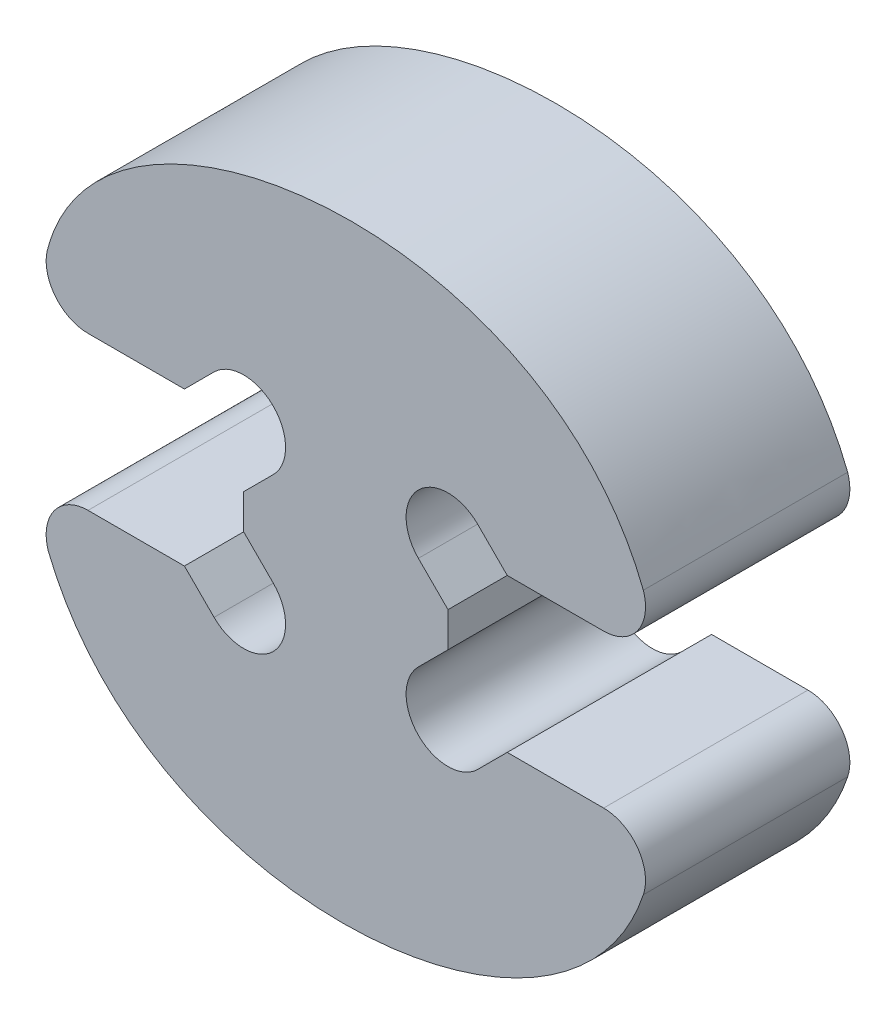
ISO-10303-21;
HEADER;
FILE_DESCRIPTION(('STEP AP214'),'2;1');
FILE_NAME('part.step','',(''),(''),'','','');
FILE_SCHEMA(('AUTOMOTIVE_DESIGN { 1 0 10303 214 1 1 1 1 }'));
ENDSEC;
DATA;
#1=APPLICATION_CONTEXT('core data for automotive mechanical design processes');
#2=APPLICATION_PROTOCOL_DEFINITION('international standard','automotive_design',2000,#1);
#3=PRODUCT_CONTEXT('',#1,'mechanical');
#4=PRODUCT('Part','Part','',(#3));
#5=PRODUCT_RELATED_PRODUCT_CATEGORY('part','',(#4));
#6=PRODUCT_DEFINITION_FORMATION('','',#4);
#7=PRODUCT_DEFINITION_CONTEXT('part definition',#1,'design');
#8=PRODUCT_DEFINITION('design','',#6,#7);
#9=PRODUCT_DEFINITION_SHAPE('','',#8);
#10=(LENGTH_UNIT() NAMED_UNIT(*) SI_UNIT(.MILLI.,.METRE.));
#11=(NAMED_UNIT(*) PLANE_ANGLE_UNIT() SI_UNIT($,.RADIAN.));
#12=(NAMED_UNIT(*) SI_UNIT($,.STERADIAN.) SOLID_ANGLE_UNIT());
#13=UNCERTAINTY_MEASURE_WITH_UNIT(LENGTH_MEASURE(1.E-05),#10,'distance_accuracy_value','');
#14=(GEOMETRIC_REPRESENTATION_CONTEXT(3) GLOBAL_UNCERTAINTY_ASSIGNED_CONTEXT((#13)) GLOBAL_UNIT_ASSIGNED_CONTEXT((#10,
#11,#12)) REPRESENTATION_CONTEXT('',''));
#15=CARTESIAN_POINT('',(0.,0.,0.));
#16=DIRECTION('',(0.,0.,1.));
#17=DIRECTION('',(1.,0.,0.));
#18=AXIS2_PLACEMENT_3D('',#15,#16,#17);
#19=CARTESIAN_POINT('',(547.117913,208.049117,20.));
#20=CARTESIAN_POINT('',(537.299333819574,233.210188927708,20.));
#21=CARTESIAN_POINT('',(494.462376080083,228.041735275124,20.));
#22=CARTESIAN_POINT('',(488.876985,208.049087,20.));
#23=B_SPLINE_CURVE_WITH_KNOTS('',3,(#19,#20,#21,#22),.UNSPECIFIED.,.F.,.F.,(4,4),(0.,1.),.UNSPECIFIED.);
#24=DIRECTION('',(0.,0.,-1.));
#25=VECTOR('',#24,1.);
#26=SURFACE_OF_LINEAR_EXTRUSION('',#23,#25);
#27=CARTESIAN_POINT('',(547.117913,208.049117,0.));
#28=CARTESIAN_POINT('',(537.299333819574,233.210188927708,0.));
#29=CARTESIAN_POINT('',(494.462376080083,228.041735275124,0.));
#30=CARTESIAN_POINT('',(488.876985,208.049087,0.));
#31=B_SPLINE_CURVE_WITH_KNOTS('',3,(#27,#28,#29,#30),.UNSPECIFIED.,.F.,.F.,(4,4),(0.,1.),.UNSPECIFIED.);
#32=CARTESIAN_POINT('',(547.117913,208.049117,0.));
#33=VERTEX_POINT('',#32);
#34=CARTESIAN_POINT('',(488.876985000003,208.049086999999,0.));
#35=VERTEX_POINT('',#34);
#36=EDGE_CURVE('E226',#33,#35,#31,.T.);
#37=ORIENTED_EDGE('',*,*,#36,.T.);
#38=DIRECTION('',(0.,0.,-1.));
#39=VECTOR('',#38,1.);
#40=CARTESIAN_POINT('',(488.876985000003,208.049086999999,20.));
#41=LINE('',#40,#39);
#42=CARTESIAN_POINT('',(488.876985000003,208.049086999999,20.));
#43=VERTEX_POINT('',#42);
#44=EDGE_CURVE('E11',#43,#35,#41,.T.);
#45=ORIENTED_EDGE('',*,*,#44,.F.);
#46=CARTESIAN_POINT('',(547.117913,208.049117,20.));
#47=VERTEX_POINT('',#46);
#48=EDGE_CURVE('E282',#47,#43,#23,.T.);
#49=ORIENTED_EDGE('',*,*,#48,.F.);
#50=DIRECTION('',(0.,0.,-1.));
#51=VECTOR('',#50,1.);
#52=CARTESIAN_POINT('',(547.117913,208.049117,20.));
#53=LINE('',#52,#51);
#54=EDGE_CURVE('E222',#47,#33,#53,.T.);
#55=ORIENTED_EDGE('',*,*,#54,.T.);
#56=EDGE_LOOP('',(#37,#45,#49,#55));
#57=FACE_BOUND('',#56,.T.);
#58=ADVANCED_FACE('F33',(#57),#26,.F.);
#59=CARTESIAN_POINT('',(492.762713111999,206.740997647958,20.));
#60=DIRECTION('',(0.,0.,-1.));
#61=DIRECTION('',(-1.,0.,0.));
#62=AXIS2_PLACEMENT_3D('',#59,#60,#61);
#63=CYLINDRICAL_SURFACE('',#62,4.09999764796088);
#64=CARTESIAN_POINT('',(492.762713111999,206.740997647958,0.));
#65=DIRECTION('',(0.,0.,1.));
#66=DIRECTION('',(1.,0.,0.));
#67=AXIS2_PLACEMENT_3D('',#64,#65,#66);
#68=CIRCLE('',#67,4.09999764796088);
#69=CARTESIAN_POINT('',(492.762713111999,202.640999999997,0.));
#70=VERTEX_POINT('',#69);
#71=EDGE_CURVE('E231',#35,#70,#68,.T.);
#72=ORIENTED_EDGE('',*,*,#71,.T.);
#73=DIRECTION('',(0.,0.,-1.));
#74=VECTOR('',#73,1.);
#75=CARTESIAN_POINT('',(492.762713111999,202.640999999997,20.));
#76=LINE('',#75,#74);
#77=CARTESIAN_POINT('',(492.762713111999,202.640999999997,20.));
#78=VERTEX_POINT('',#77);
#79=EDGE_CURVE('E42',#78,#70,#76,.T.);
#80=ORIENTED_EDGE('',*,*,#79,.F.);
#81=CARTESIAN_POINT('',(492.762713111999,206.740997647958,20.));
#82=DIRECTION('',(0.,0.,1.));
#83=DIRECTION('',(1.,0.,0.));
#84=AXIS2_PLACEMENT_3D('',#81,#82,#83);
#85=CIRCLE('',#84,4.09999764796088);
#86=EDGE_CURVE('E141',#43,#78,#85,.T.);
#87=ORIENTED_EDGE('',*,*,#86,.F.);
#88=ORIENTED_EDGE('',*,*,#44,.T.);
#89=EDGE_LOOP('',(#72,#80,#87,#88));
#90=FACE_BOUND('',#89,.T.);
#91=ADVANCED_FACE('F432',(#90),#63,.T.);
#92=CARTESIAN_POINT('',(492.762713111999,202.641,20.));
#93=DIRECTION('',(0.,1.,0.));
#94=DIRECTION('',(0.,0.,1.));
#95=AXIS2_PLACEMENT_3D('',#92,#93,#94);
#96=PLANE('',#95);
#97=DIRECTION('',(1.,0.,0.));
#98=VECTOR('',#97,1.);
#99=CARTESIAN_POINT('',(492.762713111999,202.641,0.));
#100=LINE('',#99,#98);
#101=CARTESIAN_POINT('',(502.19912,202.641,0.));
#102=VERTEX_POINT('',#101);
#103=EDGE_CURVE('E236',#70,#102,#100,.T.);
#104=ORIENTED_EDGE('',*,*,#103,.T.);
#105=DIRECTION('',(0.,0.,-1.));
#106=VECTOR('',#105,1.);
#107=CARTESIAN_POINT('',(502.19912,202.641,20.));
#108=LINE('',#107,#106);
#109=CARTESIAN_POINT('',(502.19912,202.641,20.));
#110=VERTEX_POINT('',#109);
#111=EDGE_CURVE('E337',#110,#102,#108,.T.);
#112=ORIENTED_EDGE('',*,*,#111,.F.);
#113=DIRECTION('',(1.,0.,0.));
#114=VECTOR('',#113,1.);
#115=CARTESIAN_POINT('',(492.762713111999,202.641,20.));
#116=LINE('',#115,#114);
#117=EDGE_CURVE('E345',#78,#110,#116,.T.);
#118=ORIENTED_EDGE('',*,*,#117,.F.);
#119=ORIENTED_EDGE('',*,*,#79,.T.);
#120=EDGE_LOOP('',(#104,#112,#118,#119));
#121=FACE_BOUND('',#120,.T.);
#122=ADVANCED_FACE('F343',(#121),#96,.F.);
#123=CARTESIAN_POINT('',(502.19912,202.641,20.));
#124=DIRECTION('',(-0.707106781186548,0.707106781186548,0.));
#125=DIRECTION('',(-0.707106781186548,-0.707106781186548,0.));
#126=AXIS2_PLACEMENT_3D('',#123,#124,#125);
#127=PLANE('',#126);
#128=DIRECTION('',(0.707106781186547,0.707106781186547,0.));
#129=VECTOR('',#128,1.);
#130=CARTESIAN_POINT('',(502.19912,202.641,0.));
#131=LINE('',#130,#129);
#132=CARTESIAN_POINT('',(505.09826,205.54014,0.));
#133=VERTEX_POINT('',#132);
#134=EDGE_CURVE('E238',#102,#133,#131,.T.);
#135=ORIENTED_EDGE('',*,*,#134,.T.);
#136=DIRECTION('',(0.,0.,-1.));
#137=VECTOR('',#136,1.);
#138=CARTESIAN_POINT('',(505.09826,205.54014,20.));
#139=LINE('',#138,#137);
#140=CARTESIAN_POINT('',(505.09826,205.54014,20.));
#141=VERTEX_POINT('',#140);
#142=EDGE_CURVE('E334',#141,#133,#139,.T.);
#143=ORIENTED_EDGE('',*,*,#142,.F.);
#144=DIRECTION('',(0.707106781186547,0.707106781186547,0.));
#145=VECTOR('',#144,1.);
#146=CARTESIAN_POINT('',(502.19912,202.641,20.));
#147=LINE('',#146,#145);
#148=EDGE_CURVE('E363',#110,#141,#147,.T.);
#149=ORIENTED_EDGE('',*,*,#148,.F.);
#150=ORIENTED_EDGE('',*,*,#111,.T.);
#151=EDGE_LOOP('',(#135,#143,#149,#150));
#152=FACE_BOUND('',#151,.T.);
#153=ADVANCED_FACE('F354',(#152),#127,.F.);
#154=CARTESIAN_POINT('',(507.9974,202.641,20.));
#155=DIRECTION('',(0.,0.,-1.));
#156=DIRECTION('',(-1.,0.,0.));
#157=AXIS2_PLACEMENT_3D('',#154,#155,#156);
#158=CYLINDRICAL_SURFACE('',#157,4.10000310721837);
#159=CARTESIAN_POINT('',(507.9974,202.641,0.));
#160=DIRECTION('',(0.,0.,-1.));
#161=DIRECTION('',(-1.,0.,0.));
#162=AXIS2_PLACEMENT_3D('',#159,#160,#161);
#163=CIRCLE('',#162,4.10000310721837);
#164=CARTESIAN_POINT('',(510.89654,199.74186,0.));
#165=VERTEX_POINT('',#164);
#166=EDGE_CURVE('E240',#133,#165,#163,.T.);
#167=ORIENTED_EDGE('',*,*,#166,.T.);
#168=DIRECTION('',(0.,0.,-1.));
#169=VECTOR('',#168,1.);
#170=CARTESIAN_POINT('',(510.89654,199.74186,20.));
#171=LINE('',#170,#169);
#172=CARTESIAN_POINT('',(510.89654,199.74186,20.));
#173=VERTEX_POINT('',#172);
#174=EDGE_CURVE('E331',#173,#165,#171,.T.);
#175=ORIENTED_EDGE('',*,*,#174,.F.);
#176=CARTESIAN_POINT('',(507.9974,202.641,20.));
#177=DIRECTION('',(0.,0.,-1.));
#178=DIRECTION('',(-1.,0.,0.));
#179=AXIS2_PLACEMENT_3D('',#176,#177,#178);
#180=CIRCLE('',#179,4.10000310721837);
#181=EDGE_CURVE('E360',#141,#173,#180,.T.);
#182=ORIENTED_EDGE('',*,*,#181,.F.);
#183=ORIENTED_EDGE('',*,*,#142,.T.);
#184=EDGE_LOOP('',(#167,#175,#182,#183));
#185=FACE_BOUND('',#184,.T.);
#186=ADVANCED_FACE('F358',(#185),#158,.F.);
#187=CARTESIAN_POINT('',(510.89654,199.74186,20.));
#188=DIRECTION('',(0.707106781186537,-0.707106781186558,0.));
#189=DIRECTION('',(0.707106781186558,0.707106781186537,0.));
#190=AXIS2_PLACEMENT_3D('',#187,#188,#189);
#191=PLANE('',#190);
#192=DIRECTION('',(-0.707106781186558,-0.707106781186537,0.));
#193=VECTOR('',#192,1.);
#194=CARTESIAN_POINT('',(510.89654,199.74186,0.));
#195=LINE('',#194,#193);
#196=CARTESIAN_POINT('',(507.9974,196.84272,0.));
#197=VERTEX_POINT('',#196);
#198=EDGE_CURVE('E242',#165,#197,#195,.T.);
#199=ORIENTED_EDGE('',*,*,#198,.T.);
#200=DIRECTION('',(0.,0.,-1.));
#201=VECTOR('',#200,1.);
#202=CARTESIAN_POINT('',(507.9974,196.84272,20.));
#203=LINE('',#202,#201);
#204=CARTESIAN_POINT('',(507.9974,196.84272,20.));
#205=VERTEX_POINT('',#204);
#206=EDGE_CURVE('E328',#205,#197,#203,.T.);
#207=ORIENTED_EDGE('',*,*,#206,.F.);
#208=DIRECTION('',(-0.707106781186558,-0.707106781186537,0.));
#209=VECTOR('',#208,1.);
#210=CARTESIAN_POINT('',(510.89654,199.74186,20.));
#211=LINE('',#210,#209);
#212=EDGE_CURVE('E362',#173,#205,#211,.T.);
#213=ORIENTED_EDGE('',*,*,#212,.F.);
#214=ORIENTED_EDGE('',*,*,#174,.T.);
#215=EDGE_LOOP('',(#199,#207,#213,#214));
#216=FACE_BOUND('',#215,.T.);
#217=ADVANCED_FACE('F422',(#216),#191,.F.);
#218=CARTESIAN_POINT('',(507.9974,196.84272,20.));
#219=DIRECTION('',(1.,0.,0.));
#220=DIRECTION('',(0.,0.,-1.));
#221=AXIS2_PLACEMENT_3D('',#218,#219,#220);
#222=PLANE('',#221);
#223=DIRECTION('',(0.,-1.,0.));
#224=VECTOR('',#223,1.);
#225=CARTESIAN_POINT('',(507.9974,196.84272,0.));
#226=LINE('',#225,#224);
#227=CARTESIAN_POINT('',(507.9974,193.43928,0.));
#228=VERTEX_POINT('',#227);
#229=EDGE_CURVE('E244',#197,#228,#226,.T.);
#230=ORIENTED_EDGE('',*,*,#229,.T.);
#231=DIRECTION('',(0.,0.,-1.));
#232=VECTOR('',#231,1.);
#233=CARTESIAN_POINT('',(507.9974,193.43928,20.));
#234=LINE('',#233,#232);
#235=CARTESIAN_POINT('',(507.9974,193.43928,20.));
#236=VERTEX_POINT('',#235);
#237=EDGE_CURVE('E325',#236,#228,#234,.T.);
#238=ORIENTED_EDGE('',*,*,#237,.F.);
#239=DIRECTION('',(0.,-1.,0.));
#240=VECTOR('',#239,1.);
#241=CARTESIAN_POINT('',(507.9974,196.84272,20.));
#242=LINE('',#241,#240);
#243=EDGE_CURVE('E365',#205,#236,#242,.T.);
#244=ORIENTED_EDGE('',*,*,#243,.F.);
#245=ORIENTED_EDGE('',*,*,#206,.T.);
#246=EDGE_LOOP('',(#230,#238,#244,#245));
#247=FACE_BOUND('',#246,.T.);
#248=ADVANCED_FACE('F418',(#247),#222,.F.);
#249=CARTESIAN_POINT('',(507.9974,193.43928,20.));
#250=DIRECTION('',(0.707106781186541,0.707106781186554,0.));
#251=DIRECTION('',(-0.707106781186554,0.707106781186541,0.));
#252=AXIS2_PLACEMENT_3D('',#249,#250,#251);
#253=PLANE('',#252);
#254=DIRECTION('',(0.707106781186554,-0.707106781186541,0.));
#255=VECTOR('',#254,1.);
#256=CARTESIAN_POINT('',(507.9974,193.43928,0.));
#257=LINE('',#256,#255);
#258=CARTESIAN_POINT('',(510.89654,190.54014,0.));
#259=VERTEX_POINT('',#258);
#260=EDGE_CURVE('E246',#228,#259,#257,.T.);
#261=ORIENTED_EDGE('',*,*,#260,.T.);
#262=DIRECTION('',(0.,0.,-1.));
#263=VECTOR('',#262,1.);
#264=CARTESIAN_POINT('',(510.89654,190.54014,20.));
#265=LINE('',#264,#263);
#266=CARTESIAN_POINT('',(510.89654,190.54014,20.));
#267=VERTEX_POINT('',#266);
#268=EDGE_CURVE('E322',#267,#259,#265,.T.);
#269=ORIENTED_EDGE('',*,*,#268,.F.);
#270=DIRECTION('',(0.707106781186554,-0.707106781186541,0.));
#271=VECTOR('',#270,1.);
#272=CARTESIAN_POINT('',(507.9974,193.43928,20.));
#273=LINE('',#272,#271);
#274=EDGE_CURVE('E371',#236,#267,#273,.T.);
#275=ORIENTED_EDGE('',*,*,#274,.F.);
#276=ORIENTED_EDGE('',*,*,#237,.T.);
#277=EDGE_LOOP('',(#261,#269,#275,#276));
#278=FACE_BOUND('',#277,.T.);
#279=ADVANCED_FACE('F414',(#278),#253,.F.);
#280=CARTESIAN_POINT('',(507.9974,187.641,20.));
#281=DIRECTION('',(0.,0.,-1.));
#282=DIRECTION('',(-1.,0.,0.));
#283=AXIS2_PLACEMENT_3D('',#280,#281,#282);
#284=CYLINDRICAL_SURFACE('',#283,4.10000310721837);
#285=CARTESIAN_POINT('',(507.9974,187.641,0.));
#286=DIRECTION('',(0.,0.,-1.));
#287=DIRECTION('',(-1.,0.,0.));
#288=AXIS2_PLACEMENT_3D('',#285,#286,#287);
#289=CIRCLE('',#288,4.10000310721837);
#290=CARTESIAN_POINT('',(505.09826,184.74186,0.));
#291=VERTEX_POINT('',#290);
#292=EDGE_CURVE('E248',#259,#291,#289,.T.);
#293=ORIENTED_EDGE('',*,*,#292,.T.);
#294=DIRECTION('',(0.,0.,-1.));
#295=VECTOR('',#294,1.);
#296=CARTESIAN_POINT('',(505.09826,184.74186,20.));
#297=LINE('',#296,#295);
#298=CARTESIAN_POINT('',(505.09826,184.74186,20.));
#299=VERTEX_POINT('',#298);
#300=EDGE_CURVE('E319',#299,#291,#297,.T.);
#301=ORIENTED_EDGE('',*,*,#300,.F.);
#302=CARTESIAN_POINT('',(507.9974,187.641,20.));
#303=DIRECTION('',(0.,0.,-1.));
#304=DIRECTION('',(-1.,0.,0.));
#305=AXIS2_PLACEMENT_3D('',#302,#303,#304);
#306=CIRCLE('',#305,4.10000310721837);
#307=EDGE_CURVE('E373',#267,#299,#306,.T.);
#308=ORIENTED_EDGE('',*,*,#307,.F.);
#309=ORIENTED_EDGE('',*,*,#268,.T.);
#310=EDGE_LOOP('',(#293,#301,#308,#309));
#311=FACE_BOUND('',#310,.T.);
#312=ADVANCED_FACE('F410',(#311),#284,.F.);
#313=CARTESIAN_POINT('',(505.09826,184.74186,20.));
#314=DIRECTION('',(-0.707106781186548,-0.707106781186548,0.));
#315=DIRECTION('',(0.707106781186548,-0.707106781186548,0.));
#316=AXIS2_PLACEMENT_3D('',#313,#314,#315);
#317=PLANE('',#316);
#318=DIRECTION('',(-0.707106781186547,0.707106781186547,0.));
#319=VECTOR('',#318,1.);
#320=CARTESIAN_POINT('',(505.09826,184.74186,0.));
#321=LINE('',#320,#319);
#322=CARTESIAN_POINT('',(502.19912,187.641,0.));
#323=VERTEX_POINT('',#322);
#324=EDGE_CURVE('E250',#291,#323,#321,.T.);
#325=ORIENTED_EDGE('',*,*,#324,.T.);
#326=DIRECTION('',(0.,0.,-1.));
#327=VECTOR('',#326,1.);
#328=CARTESIAN_POINT('',(502.19912,187.641,20.));
#329=LINE('',#328,#327);
#330=CARTESIAN_POINT('',(502.19912,187.641,20.));
#331=VERTEX_POINT('',#330);
#332=EDGE_CURVE('E316',#331,#323,#329,.T.);
#333=ORIENTED_EDGE('',*,*,#332,.F.);
#334=DIRECTION('',(-0.707106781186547,0.707106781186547,0.));
#335=VECTOR('',#334,1.);
#336=CARTESIAN_POINT('',(505.09826,184.74186,20.));
#337=LINE('',#336,#335);
#338=EDGE_CURVE('E375',#299,#331,#337,.T.);
#339=ORIENTED_EDGE('',*,*,#338,.F.);
#340=ORIENTED_EDGE('',*,*,#300,.T.);
#341=EDGE_LOOP('',(#325,#333,#339,#340));
#342=FACE_BOUND('',#341,.T.);
#343=ADVANCED_FACE('F406',(#342),#317,.F.);
#344=CARTESIAN_POINT('',(502.19912,187.641,20.));
#345=DIRECTION('',(0.,-1.,0.));
#346=DIRECTION('',(0.,0.,-1.));
#347=AXIS2_PLACEMENT_3D('',#344,#345,#346);
#348=PLANE('',#347);
#349=DIRECTION('',(-1.,0.,0.));
#350=VECTOR('',#349,1.);
#351=CARTESIAN_POINT('',(502.19912,187.641,0.));
#352=LINE('',#351,#350);
#353=CARTESIAN_POINT('',(492.76272,187.641,0.));
#354=VERTEX_POINT('',#353);
#355=EDGE_CURVE('E252',#323,#354,#352,.T.);
#356=ORIENTED_EDGE('',*,*,#355,.T.);
#357=DIRECTION('',(0.,0.,-1.));
#358=VECTOR('',#357,1.);
#359=CARTESIAN_POINT('',(492.76272,187.641,20.));
#360=LINE('',#359,#358);
#361=CARTESIAN_POINT('',(492.76272,187.641,20.));
#362=VERTEX_POINT('',#361);
#363=EDGE_CURVE('E313',#362,#354,#360,.T.);
#364=ORIENTED_EDGE('',*,*,#363,.F.);
#365=DIRECTION('',(-1.,0.,0.));
#366=VECTOR('',#365,1.);
#367=CARTESIAN_POINT('',(502.19912,187.641,20.));
#368=LINE('',#367,#366);
#369=EDGE_CURVE('E377',#331,#362,#368,.T.);
#370=ORIENTED_EDGE('',*,*,#369,.F.);
#371=ORIENTED_EDGE('',*,*,#332,.T.);
#372=EDGE_LOOP('',(#356,#364,#370,#371));
#373=FACE_BOUND('',#372,.T.);
#374=ADVANCED_FACE('F402',(#373),#348,.F.);
#375=CARTESIAN_POINT('',(492.762717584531,183.54099768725,20.));
#376=DIRECTION('',(0.,0.,-1.));
#377=DIRECTION('',(-1.,0.,0.));
#378=AXIS2_PLACEMENT_3D('',#375,#376,#377);
#379=CYLINDRICAL_SURFACE('',#378,4.10000231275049);
#380=CARTESIAN_POINT('',(492.762717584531,183.54099768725,0.));
#381=DIRECTION('',(0.,0.,1.));
#382=DIRECTION('',(1.,0.,0.));
#383=AXIS2_PLACEMENT_3D('',#380,#381,#382);
#384=CIRCLE('',#383,4.10000231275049);
#385=CARTESIAN_POINT('',(488.876985,182.232907,0.));
#386=VERTEX_POINT('',#385);
#387=EDGE_CURVE('E254',#354,#386,#384,.T.);
#388=ORIENTED_EDGE('',*,*,#387,.T.);
#389=DIRECTION('',(0.,0.,-1.));
#390=VECTOR('',#389,1.);
#391=CARTESIAN_POINT('',(488.876985,182.232907,20.));
#392=LINE('',#391,#390);
#393=CARTESIAN_POINT('',(488.876985,182.232907,20.));
#394=VERTEX_POINT('',#393);
#395=EDGE_CURVE('E310',#394,#386,#392,.T.);
#396=ORIENTED_EDGE('',*,*,#395,.F.);
#397=CARTESIAN_POINT('',(492.762717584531,183.54099768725,20.));
#398=DIRECTION('',(0.,0.,1.));
#399=DIRECTION('',(1.,0.,0.));
#400=AXIS2_PLACEMENT_3D('',#397,#398,#399);
#401=CIRCLE('',#400,4.10000231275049);
#402=EDGE_CURVE('E379',#362,#394,#401,.T.);
#403=ORIENTED_EDGE('',*,*,#402,.F.);
#404=ORIENTED_EDGE('',*,*,#363,.T.);
#405=EDGE_LOOP('',(#388,#396,#403,#404));
#406=FACE_BOUND('',#405,.T.);
#407=ADVANCED_FACE('F397',(#406),#379,.T.);
#408=CARTESIAN_POINT('',(488.876985,182.232907,20.));
#409=CARTESIAN_POINT('',(498.801346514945,157.679524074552,20.));
#410=CARTESIAN_POINT('',(540.107475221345,161.211357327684,20.));
#411=CARTESIAN_POINT('',(547.117915,182.232877,20.));
#412=B_SPLINE_CURVE_WITH_KNOTS('',3,(#408,#409,#410,#411),.UNSPECIFIED.,.F.,.F.,(4,4),(0.,1.),.UNSPECIFIED.);
#413=DIRECTION('',(0.,0.,-1.));
#414=VECTOR('',#413,1.);
#415=SURFACE_OF_LINEAR_EXTRUSION('',#412,#414);
#416=CARTESIAN_POINT('',(488.876985,182.232907,0.));
#417=CARTESIAN_POINT('',(498.801346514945,157.679524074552,0.));
#418=CARTESIAN_POINT('',(540.107475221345,161.211357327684,0.));
#419=CARTESIAN_POINT('',(547.117915,182.232877,0.));
#420=B_SPLINE_CURVE_WITH_KNOTS('',3,(#416,#417,#418,#419),.UNSPECIFIED.,.F.,.F.,(4,4),(0.,1.),.UNSPECIFIED.);
#421=CARTESIAN_POINT('',(547.117915,182.232877,0.));
#422=VERTEX_POINT('',#421);
#423=EDGE_CURVE('E256',#386,#422,#420,.T.);
#424=ORIENTED_EDGE('',*,*,#423,.T.);
#425=DIRECTION('',(0.,0.,-1.));
#426=VECTOR('',#425,1.);
#427=CARTESIAN_POINT('',(547.117915,182.232877,20.));
#428=LINE('',#427,#426);
#429=CARTESIAN_POINT('',(547.117915,182.232877,20.));
#430=VERTEX_POINT('',#429);
#431=EDGE_CURVE('E307',#430,#422,#428,.T.);
#432=ORIENTED_EDGE('',*,*,#431,.F.);
#433=EDGE_CURVE('E381',#394,#430,#412,.T.);
#434=ORIENTED_EDGE('',*,*,#433,.F.);
#435=ORIENTED_EDGE('',*,*,#395,.T.);
#436=EDGE_LOOP('',(#424,#432,#434,#435));
#437=FACE_BOUND('',#436,.T.);
#438=ADVANCED_FACE('F392',(#437),#415,.F.);
#439=CARTESIAN_POINT('',(543.232196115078,183.541000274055,20.));
#440=DIRECTION('',(0.,0.,-1.));
#441=DIRECTION('',(-1.,0.,0.));
#442=AXIS2_PLACEMENT_3D('',#439,#440,#441);
#443=CYLINDRICAL_SURFACE('',#442,4.09999972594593);
#444=CARTESIAN_POINT('',(543.232196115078,183.541000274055,0.));
#445=DIRECTION('',(0.,0.,1.));
#446=DIRECTION('',(1.,0.,0.));
#447=AXIS2_PLACEMENT_3D('',#444,#445,#446);
#448=CIRCLE('',#447,4.09999972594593);
#449=CARTESIAN_POINT('',(543.232196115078,187.641000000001,0.));
#450=VERTEX_POINT('',#449);
#451=EDGE_CURVE('E260',#422,#450,#448,.T.);
#452=ORIENTED_EDGE('',*,*,#451,.T.);
#453=DIRECTION('',(0.,0.,-1.));
#454=VECTOR('',#453,1.);
#455=CARTESIAN_POINT('',(543.232196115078,187.641000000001,20.));
#456=LINE('',#455,#454);
#457=CARTESIAN_POINT('',(543.232196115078,187.641000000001,20.));
#458=VERTEX_POINT('',#457);
#459=EDGE_CURVE('E304',#458,#450,#456,.T.);
#460=ORIENTED_EDGE('',*,*,#459,.F.);
#461=CARTESIAN_POINT('',(543.232196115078,183.541000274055,20.));
#462=DIRECTION('',(0.,0.,1.));
#463=DIRECTION('',(1.,0.,0.));
#464=AXIS2_PLACEMENT_3D('',#461,#462,#463);
#465=CIRCLE('',#464,4.09999972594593);
#466=EDGE_CURVE('E386',#430,#458,#465,.T.);
#467=ORIENTED_EDGE('',*,*,#466,.F.);
#468=ORIENTED_EDGE('',*,*,#431,.T.);
#469=EDGE_LOOP('',(#452,#460,#467,#468));
#470=FACE_BOUND('',#469,.T.);
#471=ADVANCED_FACE('F396',(#470),#443,.T.);
#472=CARTESIAN_POINT('',(533.79568,187.641,20.));
#473=DIRECTION('',(0.,-1.,0.));
#474=DIRECTION('',(0.,0.,-1.));
#475=AXIS2_PLACEMENT_3D('',#472,#473,#474);
#476=PLANE('',#475);
#477=DIRECTION('',(-1.,0.,0.));
#478=VECTOR('',#477,1.);
#479=CARTESIAN_POINT('',(533.79568,187.641,0.));
#480=LINE('',#479,#478);
#481=CARTESIAN_POINT('',(533.79568,187.641,0.));
#482=VERTEX_POINT('',#481);
#483=EDGE_CURVE('E265',#450,#482,#480,.T.);
#484=ORIENTED_EDGE('',*,*,#483,.T.);
#485=DIRECTION('',(0.,0.,-1.));
#486=VECTOR('',#485,1.);
#487=CARTESIAN_POINT('',(533.79568,187.641,20.));
#488=LINE('',#487,#486);
#489=CARTESIAN_POINT('',(533.79568,187.641,20.));
#490=VERTEX_POINT('',#489);
#491=EDGE_CURVE('E301',#490,#482,#488,.T.);
#492=ORIENTED_EDGE('',*,*,#491,.F.);
#493=DIRECTION('',(-1.,0.,0.));
#494=VECTOR('',#493,1.);
#495=CARTESIAN_POINT('',(533.79568,187.641,20.));
#496=LINE('',#495,#494);
#497=EDGE_CURVE('E481',#458,#490,#496,.T.);
#498=ORIENTED_EDGE('',*,*,#497,.F.);
#499=ORIENTED_EDGE('',*,*,#459,.T.);
#500=EDGE_LOOP('',(#484,#492,#498,#499));
#501=FACE_BOUND('',#500,.T.);
#502=ADVANCED_FACE('F478',(#501),#476,.F.);
#503=CARTESIAN_POINT('',(533.79568,187.641,20.));
#504=DIRECTION('',(0.707106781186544,-0.707106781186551,0.));
#505=DIRECTION('',(0.707106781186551,0.707106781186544,0.));
#506=AXIS2_PLACEMENT_3D('',#503,#504,#505);
#507=PLANE('',#506);
#508=DIRECTION('',(-0.707106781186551,-0.707106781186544,0.));
#509=VECTOR('',#508,1.);
#510=CARTESIAN_POINT('',(533.79568,187.641,0.));
#511=LINE('',#510,#509);
#512=CARTESIAN_POINT('',(530.89654,184.74186,0.));
#513=VERTEX_POINT('',#512);
#514=EDGE_CURVE('E267',#482,#513,#511,.T.);
#515=ORIENTED_EDGE('',*,*,#514,.T.);
#516=DIRECTION('',(0.,0.,-1.));
#517=VECTOR('',#516,1.);
#518=CARTESIAN_POINT('',(530.89654,184.74186,20.));
#519=LINE('',#518,#517);
#520=CARTESIAN_POINT('',(530.89654,184.74186,20.));
#521=VERTEX_POINT('',#520);
#522=EDGE_CURVE('E298',#521,#513,#519,.T.);
#523=ORIENTED_EDGE('',*,*,#522,.F.);
#524=DIRECTION('',(-0.707106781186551,-0.707106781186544,0.));
#525=VECTOR('',#524,1.);
#526=CARTESIAN_POINT('',(533.79568,187.641,20.));
#527=LINE('',#526,#525);
#528=EDGE_CURVE('E472',#490,#521,#527,.T.);
#529=ORIENTED_EDGE('',*,*,#528,.F.);
#530=ORIENTED_EDGE('',*,*,#491,.T.);
#531=EDGE_LOOP('',(#515,#523,#529,#530));
#532=FACE_BOUND('',#531,.T.);
#533=ADVANCED_FACE('F471',(#532),#507,.F.);
#534=CARTESIAN_POINT('',(527.9974,187.641,20.));
#535=DIRECTION('',(0.,0.,-1.));
#536=DIRECTION('',(-1.,0.,0.));
#537=AXIS2_PLACEMENT_3D('',#534,#535,#536);
#538=CYLINDRICAL_SURFACE('',#537,4.10000310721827);
#539=CARTESIAN_POINT('',(527.9974,187.641,0.));
#540=DIRECTION('',(0.,0.,-1.));
#541=DIRECTION('',(-1.,0.,0.));
#542=AXIS2_PLACEMENT_3D('',#539,#540,#541);
#543=CIRCLE('',#542,4.10000310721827);
#544=CARTESIAN_POINT('',(525.09826,190.54014,0.));
#545=VERTEX_POINT('',#544);
#546=EDGE_CURVE('E269',#513,#545,#543,.T.);
#547=ORIENTED_EDGE('',*,*,#546,.T.);
#548=DIRECTION('',(0.,0.,-1.));
#549=VECTOR('',#548,1.);
#550=CARTESIAN_POINT('',(525.09826,190.54014,20.));
#551=LINE('',#550,#549);
#552=CARTESIAN_POINT('',(525.09826,190.54014,20.));
#553=VERTEX_POINT('',#552);
#554=EDGE_CURVE('E295',#553,#545,#551,.T.);
#555=ORIENTED_EDGE('',*,*,#554,.F.);
#556=CARTESIAN_POINT('',(527.9974,187.641,20.));
#557=DIRECTION('',(0.,0.,-1.));
#558=DIRECTION('',(-1.,0.,0.));
#559=AXIS2_PLACEMENT_3D('',#556,#557,#558);
#560=CIRCLE('',#559,4.10000310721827);
#561=EDGE_CURVE('E467',#521,#553,#560,.T.);
#562=ORIENTED_EDGE('',*,*,#561,.F.);
#563=ORIENTED_EDGE('',*,*,#522,.T.);
#564=EDGE_LOOP('',(#547,#555,#562,#563));
#565=FACE_BOUND('',#564,.T.);
#566=ADVANCED_FACE('F466',(#565),#538,.F.);
#567=CARTESIAN_POINT('',(525.09826,190.54014,20.));
#568=DIRECTION('',(-0.707106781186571,0.707106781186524,0.));
#569=DIRECTION('',(-0.707106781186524,-0.707106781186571,0.));
#570=AXIS2_PLACEMENT_3D('',#567,#568,#569);
#571=PLANE('',#570);
#572=DIRECTION('',(0.707106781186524,0.707106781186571,0.));
#573=VECTOR('',#572,1.);
#574=CARTESIAN_POINT('',(525.09826,190.54014,0.));
#575=LINE('',#574,#573);
#576=CARTESIAN_POINT('',(527.9974,193.43928,0.));
#577=VERTEX_POINT('',#576);
#578=EDGE_CURVE('E271',#545,#577,#575,.T.);
#579=ORIENTED_EDGE('',*,*,#578,.T.);
#580=DIRECTION('',(0.,0.,-1.));
#581=VECTOR('',#580,1.);
#582=CARTESIAN_POINT('',(527.9974,193.43928,20.));
#583=LINE('',#582,#581);
#584=CARTESIAN_POINT('',(527.9974,193.43928,20.));
#585=VERTEX_POINT('',#584);
#586=EDGE_CURVE('E292',#585,#577,#583,.T.);
#587=ORIENTED_EDGE('',*,*,#586,.F.);
#588=DIRECTION('',(0.707106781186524,0.707106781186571,0.));
#589=VECTOR('',#588,1.);
#590=CARTESIAN_POINT('',(525.09826,190.54014,20.));
#591=LINE('',#590,#589);
#592=EDGE_CURVE('E463',#553,#585,#591,.T.);
#593=ORIENTED_EDGE('',*,*,#592,.F.);
#594=ORIENTED_EDGE('',*,*,#554,.T.);
#595=EDGE_LOOP('',(#579,#587,#593,#594));
#596=FACE_BOUND('',#595,.T.);
#597=ADVANCED_FACE('F460',(#596),#571,.F.);
#598=CARTESIAN_POINT('',(527.9974,193.43928,20.));
#599=DIRECTION('',(-1.,0.,0.));
#600=DIRECTION('',(0.,0.,1.));
#601=AXIS2_PLACEMENT_3D('',#598,#599,#600);
#602=PLANE('',#601);
#603=DIRECTION('',(0.,1.,0.));
#604=VECTOR('',#603,1.);
#605=CARTESIAN_POINT('',(527.9974,193.43928,0.));
#606=LINE('',#605,#604);
#607=CARTESIAN_POINT('',(527.9974,196.84272,0.));
#608=VERTEX_POINT('',#607);
#609=EDGE_CURVE('E273',#577,#608,#606,.T.);
#610=ORIENTED_EDGE('',*,*,#609,.T.);
#611=DIRECTION('',(0.,0.,-1.));
#612=VECTOR('',#611,1.);
#613=CARTESIAN_POINT('',(527.9974,196.84272,20.));
#614=LINE('',#613,#612);
#615=CARTESIAN_POINT('',(527.9974,196.84272,20.));
#616=VERTEX_POINT('',#615);
#617=EDGE_CURVE('E289',#616,#608,#614,.T.);
#618=ORIENTED_EDGE('',*,*,#617,.F.);
#619=DIRECTION('',(0.,1.,0.));
#620=VECTOR('',#619,1.);
#621=CARTESIAN_POINT('',(527.9974,193.43928,20.));
#622=LINE('',#621,#620);
#623=EDGE_CURVE('E454',#585,#616,#622,.T.);
#624=ORIENTED_EDGE('',*,*,#623,.F.);
#625=ORIENTED_EDGE('',*,*,#586,.T.);
#626=EDGE_LOOP('',(#610,#618,#624,#625));
#627=FACE_BOUND('',#626,.T.);
#628=ADVANCED_FACE('F453',(#627),#602,.F.);
#629=CARTESIAN_POINT('',(527.9974,196.84272,20.));
#630=DIRECTION('',(-0.707106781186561,-0.707106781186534,0.));
#631=DIRECTION('',(0.707106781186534,-0.707106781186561,0.));
#632=AXIS2_PLACEMENT_3D('',#629,#630,#631);
#633=PLANE('',#632);
#634=DIRECTION('',(-0.707106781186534,0.707106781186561,0.));
#635=VECTOR('',#634,1.);
#636=CARTESIAN_POINT('',(527.9974,196.84272,0.));
#637=LINE('',#636,#635);
#638=CARTESIAN_POINT('',(525.09826,199.74186,0.));
#639=VERTEX_POINT('',#638);
#640=EDGE_CURVE('E275',#608,#639,#637,.T.);
#641=ORIENTED_EDGE('',*,*,#640,.T.);
#642=DIRECTION('',(0.,0.,-1.));
#643=VECTOR('',#642,1.);
#644=CARTESIAN_POINT('',(525.09826,199.74186,20.));
#645=LINE('',#644,#643);
#646=CARTESIAN_POINT('',(525.09826,199.74186,20.));
#647=VERTEX_POINT('',#646);
#648=EDGE_CURVE('E286',#647,#639,#645,.T.);
#649=ORIENTED_EDGE('',*,*,#648,.F.);
#650=DIRECTION('',(-0.707106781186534,0.707106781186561,0.));
#651=VECTOR('',#650,1.);
#652=CARTESIAN_POINT('',(527.9974,196.84272,20.));
#653=LINE('',#652,#651);
#654=EDGE_CURVE('E449',#616,#647,#653,.T.);
#655=ORIENTED_EDGE('',*,*,#654,.F.);
#656=ORIENTED_EDGE('',*,*,#617,.T.);
#657=EDGE_LOOP('',(#641,#649,#655,#656));
#658=FACE_BOUND('',#657,.T.);
#659=ADVANCED_FACE('F448',(#658),#633,.F.);
#660=CARTESIAN_POINT('',(527.9974,202.641,20.));
#661=DIRECTION('',(0.,0.,-1.));
#662=DIRECTION('',(-1.,0.,0.));
#663=AXIS2_PLACEMENT_3D('',#660,#661,#662);
#664=CYLINDRICAL_SURFACE('',#663,4.1000031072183);
#665=CARTESIAN_POINT('',(527.9974,202.641,0.));
#666=DIRECTION('',(0.,0.,-1.));
#667=DIRECTION('',(1.,0.,0.));
#668=AXIS2_PLACEMENT_3D('',#665,#666,#667);
#669=CIRCLE('',#668,4.1000031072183);
#670=CARTESIAN_POINT('',(530.89654,205.54014,0.));
#671=VERTEX_POINT('',#670);
#672=EDGE_CURVE('E277',#639,#671,#669,.T.);
#673=ORIENTED_EDGE('',*,*,#672,.T.);
#674=DIRECTION('',(0.,0.,-1.));
#675=VECTOR('',#674,1.);
#676=CARTESIAN_POINT('',(530.89654,205.54014,20.));
#677=LINE('',#676,#675);
#678=CARTESIAN_POINT('',(530.89654,205.54014,20.));
#679=VERTEX_POINT('',#678);
#680=EDGE_CURVE('E217',#679,#671,#677,.T.);
#681=ORIENTED_EDGE('',*,*,#680,.F.);
#682=CARTESIAN_POINT('',(527.9974,202.641,20.));
#683=DIRECTION('',(0.,0.,-1.));
#684=DIRECTION('',(1.,0.,0.));
#685=AXIS2_PLACEMENT_3D('',#682,#683,#684);
#686=CIRCLE('',#685,4.1000031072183);
#687=EDGE_CURVE('E208',#647,#679,#686,.T.);
#688=ORIENTED_EDGE('',*,*,#687,.F.);
#689=ORIENTED_EDGE('',*,*,#648,.T.);
#690=EDGE_LOOP('',(#673,#681,#688,#689));
#691=FACE_BOUND('',#690,.T.);
#692=ADVANCED_FACE('F444',(#691),#664,.F.);
#693=CARTESIAN_POINT('',(533.79568,202.641,20.));
#694=DIRECTION('',(0.707106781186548,0.707106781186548,0.));
#695=DIRECTION('',(-0.707106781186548,0.707106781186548,0.));
#696=AXIS2_PLACEMENT_3D('',#693,#694,#695);
#697=PLANE('',#696);
#698=DIRECTION('',(0.707106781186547,-0.707106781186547,0.));
#699=VECTOR('',#698,1.);
#700=CARTESIAN_POINT('',(533.79568,202.641,0.));
#701=LINE('',#700,#699);
#702=CARTESIAN_POINT('',(533.79568,202.641,0.));
#703=VERTEX_POINT('',#702);
#704=EDGE_CURVE('E216',#671,#703,#701,.T.);
#705=ORIENTED_EDGE('',*,*,#704,.T.);
#706=DIRECTION('',(0.,0.,-1.));
#707=VECTOR('',#706,1.);
#708=CARTESIAN_POINT('',(533.79568,202.641,20.));
#709=LINE('',#708,#707);
#710=CARTESIAN_POINT('',(533.79568,202.641,20.));
#711=VERTEX_POINT('',#710);
#712=EDGE_CURVE('E213',#711,#703,#709,.T.);
#713=ORIENTED_EDGE('',*,*,#712,.F.);
#714=DIRECTION('',(0.707106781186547,-0.707106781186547,0.));
#715=VECTOR('',#714,1.);
#716=CARTESIAN_POINT('',(533.79568,202.641,20.));
#717=LINE('',#716,#715);
#718=EDGE_CURVE('E202',#679,#711,#717,.T.);
#719=ORIENTED_EDGE('',*,*,#718,.F.);
#720=ORIENTED_EDGE('',*,*,#680,.T.);
#721=EDGE_LOOP('',(#705,#713,#719,#720));
#722=FACE_BOUND('',#721,.T.);
#723=ADVANCED_FACE('F214',(#722),#697,.F.);
#724=CARTESIAN_POINT('',(533.79568,202.641,20.));
#725=DIRECTION('',(0.,1.,0.));
#726=DIRECTION('',(0.,0.,1.));
#727=AXIS2_PLACEMENT_3D('',#724,#725,#726);
#728=PLANE('',#727);
#729=DIRECTION('',(1.,0.,0.));
#730=VECTOR('',#729,1.);
#731=CARTESIAN_POINT('',(533.79568,202.641,0.));
#732=LINE('',#731,#730);
#733=CARTESIAN_POINT('',(543.2322,202.641,0.));
#734=VERTEX_POINT('',#733);
#735=EDGE_CURVE('E127',#703,#734,#732,.T.);
#736=ORIENTED_EDGE('',*,*,#735,.T.);
#737=DIRECTION('',(0.,0.,-1.));
#738=VECTOR('',#737,1.);
#739=CARTESIAN_POINT('',(543.2322,202.641,20.));
#740=LINE('',#739,#738);
#741=CARTESIAN_POINT('',(543.2322,202.641,20.));
#742=VERTEX_POINT('',#741);
#743=EDGE_CURVE('E218',#742,#734,#740,.T.);
#744=ORIENTED_EDGE('',*,*,#743,.F.);
#745=DIRECTION('',(1.,0.,0.));
#746=VECTOR('',#745,1.);
#747=CARTESIAN_POINT('',(533.79568,202.641,20.));
#748=LINE('',#747,#746);
#749=EDGE_CURVE('E206',#711,#742,#748,.T.);
#750=ORIENTED_EDGE('',*,*,#749,.F.);
#751=ORIENTED_EDGE('',*,*,#712,.T.);
#752=EDGE_LOOP('',(#736,#744,#750,#751));
#753=FACE_BOUND('',#752,.T.);
#754=ADVANCED_FACE('F220',(#753),#728,.F.);
#755=CARTESIAN_POINT('',(543.232194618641,206.740997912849,20.));
#756=DIRECTION('',(0.,0.,-1.));
#757=DIRECTION('',(-1.,0.,0.));
#758=AXIS2_PLACEMENT_3D('',#755,#756,#757);
#759=CYLINDRICAL_SURFACE('',#758,4.09999791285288);
#760=CARTESIAN_POINT('',(543.232194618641,206.740997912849,0.));
#761=DIRECTION('',(0.,0.,1.));
#762=DIRECTION('',(1.,0.,0.));
#763=AXIS2_PLACEMENT_3D('',#760,#761,#762);
#764=CIRCLE('',#763,4.09999791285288);
#765=EDGE_CURVE('E133',#734,#33,#764,.T.);
#766=ORIENTED_EDGE('',*,*,#765,.T.);
#767=ORIENTED_EDGE('',*,*,#54,.F.);
#768=CARTESIAN_POINT('',(543.232194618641,206.740997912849,20.));
#769=DIRECTION('',(0.,0.,1.));
#770=DIRECTION('',(1.,0.,0.));
#771=AXIS2_PLACEMENT_3D('',#768,#769,#770);
#772=CIRCLE('',#771,4.09999791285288);
#773=EDGE_CURVE('E50',#742,#47,#772,.T.);
#774=ORIENTED_EDGE('',*,*,#773,.F.);
#775=ORIENTED_EDGE('',*,*,#743,.T.);
#776=EDGE_LOOP('',(#766,#767,#774,#775));
#777=FACE_BOUND('',#776,.T.);
#778=ADVANCED_FACE('F533',(#777),#759,.T.);
#779=CARTESIAN_POINT('',(516.410003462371,224.981747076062,20.));
#780=DIRECTION('',(0.,0.,1.));
#781=DIRECTION('',(1.,0.,0.));
#782=AXIS2_PLACEMENT_3D('',#779,#780,#781);
#783=PLANE('',#782);
#784=ORIENTED_EDGE('',*,*,#48,.T.);
#785=ORIENTED_EDGE('',*,*,#86,.T.);
#786=ORIENTED_EDGE('',*,*,#117,.T.);
#787=ORIENTED_EDGE('',*,*,#148,.T.);
#788=ORIENTED_EDGE('',*,*,#181,.T.);
#789=ORIENTED_EDGE('',*,*,#212,.T.);
#790=ORIENTED_EDGE('',*,*,#243,.T.);
#791=ORIENTED_EDGE('',*,*,#274,.T.);
#792=ORIENTED_EDGE('',*,*,#307,.T.);
#793=ORIENTED_EDGE('',*,*,#338,.T.);
#794=ORIENTED_EDGE('',*,*,#369,.T.);
#795=ORIENTED_EDGE('',*,*,#402,.T.);
#796=ORIENTED_EDGE('',*,*,#433,.T.);
#797=ORIENTED_EDGE('',*,*,#466,.T.);
#798=ORIENTED_EDGE('',*,*,#497,.T.);
#799=ORIENTED_EDGE('',*,*,#528,.T.);
#800=ORIENTED_EDGE('',*,*,#561,.T.);
#801=ORIENTED_EDGE('',*,*,#592,.T.);
#802=ORIENTED_EDGE('',*,*,#623,.T.);
#803=ORIENTED_EDGE('',*,*,#654,.T.);
#804=ORIENTED_EDGE('',*,*,#687,.T.);
#805=ORIENTED_EDGE('',*,*,#718,.T.);
#806=ORIENTED_EDGE('',*,*,#749,.T.);
#807=ORIENTED_EDGE('',*,*,#773,.T.);
#808=EDGE_LOOP('',(#784,#785,#786,#787,#788,#789,#790,#791,#792,#793,#794,#795,#796,#797,#798,
#799,#800,#801,#802,#803,#804,#805,#806,#807));
#809=FACE_BOUND('',#808,.T.);
#810=ADVANCED_FACE('F204',(#809),#783,.T.);
#811=CARTESIAN_POINT('',(516.410003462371,224.981747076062,0.));
#812=DIRECTION('',(0.,0.,1.));
#813=DIRECTION('',(1.,0.,0.));
#814=AXIS2_PLACEMENT_3D('',#811,#812,#813);
#815=PLANE('',#814);
#816=ORIENTED_EDGE('',*,*,#36,.F.);
#817=ORIENTED_EDGE('',*,*,#765,.F.);
#818=ORIENTED_EDGE('',*,*,#735,.F.);
#819=ORIENTED_EDGE('',*,*,#704,.F.);
#820=ORIENTED_EDGE('',*,*,#672,.F.);
#821=ORIENTED_EDGE('',*,*,#640,.F.);
#822=ORIENTED_EDGE('',*,*,#609,.F.);
#823=ORIENTED_EDGE('',*,*,#578,.F.);
#824=ORIENTED_EDGE('',*,*,#546,.F.);
#825=ORIENTED_EDGE('',*,*,#514,.F.);
#826=ORIENTED_EDGE('',*,*,#483,.F.);
#827=ORIENTED_EDGE('',*,*,#451,.F.);
#828=ORIENTED_EDGE('',*,*,#423,.F.);
#829=ORIENTED_EDGE('',*,*,#387,.F.);
#830=ORIENTED_EDGE('',*,*,#355,.F.);
#831=ORIENTED_EDGE('',*,*,#324,.F.);
#832=ORIENTED_EDGE('',*,*,#292,.F.);
#833=ORIENTED_EDGE('',*,*,#260,.F.);
#834=ORIENTED_EDGE('',*,*,#229,.F.);
#835=ORIENTED_EDGE('',*,*,#198,.F.);
#836=ORIENTED_EDGE('',*,*,#166,.F.);
#837=ORIENTED_EDGE('',*,*,#134,.F.);
#838=ORIENTED_EDGE('',*,*,#103,.F.);
#839=ORIENTED_EDGE('',*,*,#71,.F.);
#840=EDGE_LOOP('',(#816,#817,#818,#819,#820,#821,#822,#823,#824,#825,#826,#827,#828,#829,#830,
#831,#832,#833,#834,#835,#836,#837,#838,#839));
#841=FACE_BOUND('',#840,.T.);
#842=ADVANCED_FACE('F349',(#841),#815,.F.);
#843=CLOSED_SHELL('',(#58,#91,#122,#153,#186,#217,#248,#279,#312,#343,#374,#407,#438,#471,#502,
#533,#566,#597,#628,#659,#692,#723,#754,#778,#810,#842));
#844=MANIFOLD_SOLID_BREP('B2',#843);
#845=ADVANCED_BREP_SHAPE_REPRESENTATION('',(#18,#844),#14);
#846=SHAPE_DEFINITION_REPRESENTATION(#9,#845);
ENDSEC;
END-ISO-10303-21;
